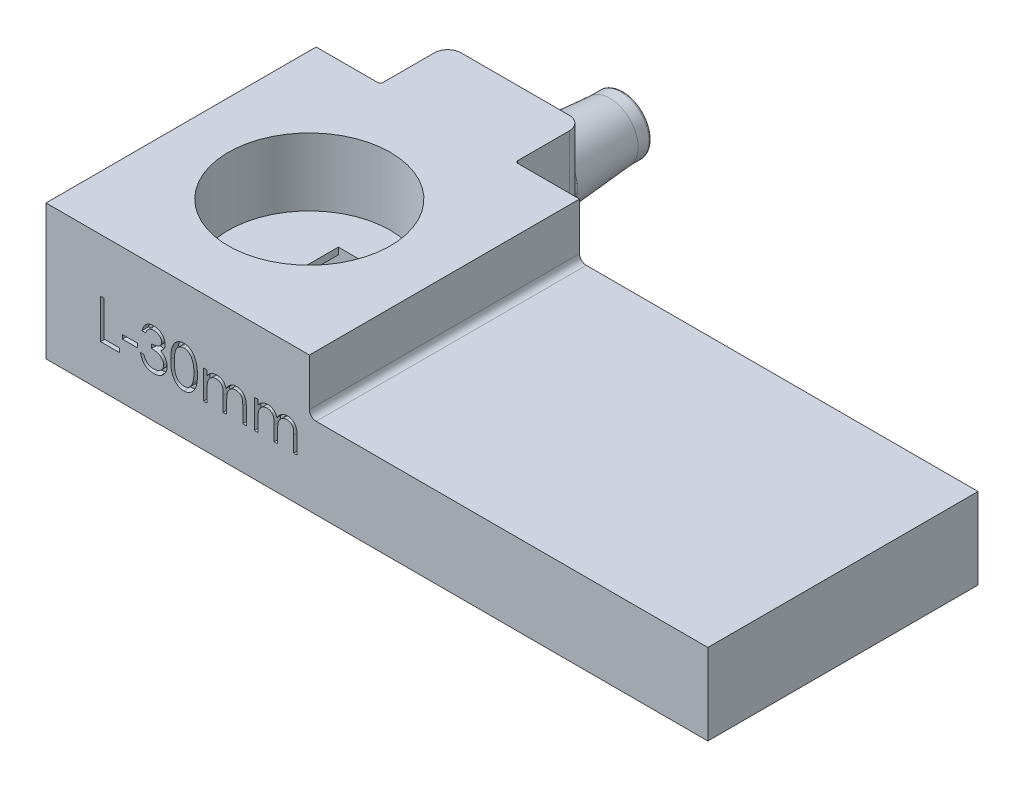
from build123d import *

# Parameters (mm, degrees)
SKETCH2_W           = 49
SKETCH2_H           = 20
BOSS_EXTRUDE1_DEPTH = 10
SKETCH3_W           = 30
SKETCH3_H           = 3.02
CUT_EXTRUDE1_DEPTH  = 2
SKETCH4_W           = 5
SKETCH4_H           = 6
CUT_EXTRUDE2_DEPTH  = 5
SKETCH5_R           = 6
CUT_EXTRUDE3_DEPTH  = 38.474986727
SKETCH6_W           = 1.65
SKETCH6_H           = 6
BOSS_EXTRUDE2_DEPTH = 0.5
SKETCH11_R          = 2
CUT_EXTRUDE4_DEPTH  = 2
SKETCH12_W          = 5
SKETCH12_H          = 6
BOSS_EXTRUDE4_DEPTH = 0.8
SKETCH14_W          = 29.5
SKETCH14_H          = 4
CUT_EXTRUDE6_DEPTH  = 42.177221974
FILLET1_R           = 0.5
SKETCH13_W          = 1.119391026
SKETCH13_H          = 0.298504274
CUT_EXTRUDE5_DEPTH  = 0.5
SKETCH19_W          = 10
SKETCH19_H          = 4.99
BOSS_EXTRUDE5_DEPTH = 10
FILLET2_R           = 1
CUT_EXTRUDE7_REACH  = 45.819
SKETCH20_R          = 0.5
SKETCH21_R          = 1.4
CUT_EXTRUDE8_DEPTH  = 10
FILLET3_R           = 0.2


with BuildPart() as part:
    # Sketch2 → Boss-Extrude1 (new body)
    with BuildSketch(Plane(origin=(0, 0, 0), x_dir=(1, 0, 0), z_dir=(0, 1, 0))):
        with Locations((10.076923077, 3.557692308)):
            Rectangle(SKETCH2_W, SKETCH2_H)
    extrude(amount=BOSS_EXTRUDE1_DEPTH)

    # Sketch3 → Cut-Extrude1 (cut)
    with BuildSketch(Plane.XZ):
        with Locations((12.576923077, -3.557692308)):
            Rectangle(SKETCH3_W, SKETCH3_H)
    extrude(amount=-CUT_EXTRUDE1_DEPTH, mode=Mode.SUBTRACT)

    # Sketch4 → Cut-Extrude2 (cut)
    with BuildSketch(Plane.XZ):
        with Locations((-4.923076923, -3.547692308)):
            Rectangle(SKETCH4_W, SKETCH4_H)
    extrude(amount=-CUT_EXTRUDE2_DEPTH, mode=Mode.SUBTRACT)

    # Sketch5 → Cut-Extrude3 (cut, through all)
    with BuildSketch(Plane.XZ.offset(-5)):
        with Locations(Location((-4.923076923, -3.552692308, 0), (0, 0, 270))):
            Circle(SKETCH5_R)
    extrude(amount=-CUT_EXTRUDE3_DEPTH, mode=Mode.SUBTRACT)

    # Sketch6 → Boss-Extrude2 (add)
    with BuildSketch(Plane(origin=(0, 5, 0), x_dir=(1, 0, 0), z_dir=(0, 1, 0))):
        with Locations((-3.248076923, 3.547692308)):
            Rectangle(SKETCH6_W, SKETCH6_H)
        with Locations((-6.598076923, 3.547692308)):
            Rectangle(SKETCH6_W, SKETCH6_H)
    extrude(amount=-BOSS_EXTRUDE2_DEPTH)

    # Sketch11 → Cut-Extrude4 (cut)
    with BuildSketch(Plane.XZ):
        with Locations((28.888372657, -3.557692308)):
            Circle(SKETCH11_R)
    extrude(amount=-CUT_EXTRUDE4_DEPTH, mode=Mode.SUBTRACT)

    # Sketch12 → Boss-Extrude4 (add)
    with BuildSketch(Plane.XZ):
        with Locations((-4.923076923, -3.547692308)):
            Rectangle(SKETCH12_W, SKETCH12_H)
    extrude(amount=-BOSS_EXTRUDE4_DEPTH)

    # Sketch14 → Cut-Extrude6 (cut, through all)
    with BuildSketch(Plane.XY.offset(6.442307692)):
        with Locations((19.826923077, 8)):
            Rectangle(SKETCH14_W, SKETCH14_H)
    extrude(amount=-CUT_EXTRUDE6_DEPTH, mode=Mode.SUBTRACT)

    # Fillet1
    fillet1_edges = [part.edges().sort_by_distance(p)[0] for p in [
        (5.076923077, 6, -3.557692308),
    ]]
    fillet(fillet1_edges, radius=FILLET1_R)

    # Sketch13 → Cut-Extrude5 (cut)
    # profile 1 of 6: a face of its own
    with BuildSketch(Plane.XY.offset(6.442307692)):
        Polygon((-10.374825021, 6.036177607), (-10.113633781, 6.036177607), (-10.113633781, 3.424265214), (-8.994242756, 3.424265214), (-8.994242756, 3.12576094), (-10.374825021, 3.12576094), align=None)
    # profile 2 of 6: a face of its own
    with BuildSketch(Plane.XY.offset(6.442307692)):
        with Locations((-8.210669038, 4.245151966)):
            Rectangle(SKETCH13_W, SKETCH13_H)
    # profile 3 of 6: a face of its own
    with BuildSketch(Plane.XY.offset(6.442307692)):
        with BuildLine():
            Line((-7.053964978, 5.364542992), (-7.315156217, 5.364542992))
            add(Edge.make_bspline(
                [(-7.315156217, 5.364542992), (-7.308080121, 5.39384048), (-7.294246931, 5.451114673), (-7.265394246, 5.532944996), (-7.233962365, 5.610381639), (-7.196219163, 5.681974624), (-7.155050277, 5.749162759), (-7.107882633, 5.810422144), (-7.056892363, 5.867310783), (-7.000492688, 5.917796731), (-6.941345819, 5.963513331), (-6.878618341, 6.002492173), (-6.81357228, 6.036023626), (-6.745756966, 6.063647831), (-6.674970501, 6.084457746), (-6.601852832, 6.099555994), (-6.52621235, 6.109360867), (-6.474866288, 6.110317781), (-6.448794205, 6.110803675)],
                knots=[0, 0, 0, 0, 1.162005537, 2.271625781, 3.343758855, 4.383309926, 5.390229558, 6.379919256, 7.361854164, 8.333198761, 9.295911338, 10.242430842, 11.177959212, 12.116337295, 13.062827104, 14.020064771, 14.994644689, 16, 16, 16, 16], degree=3))
            add(Edge.make_bspline(
                [(-6.448794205, 6.110803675), (-6.410806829, 6.10965678), (-6.335660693, 6.107388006), (-6.225261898, 6.086670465), (-6.118801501, 6.05388659), (-6.017444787, 6.008589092), (-5.923298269, 5.952719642), (-5.839531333, 5.886225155), (-5.767279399, 5.810388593), (-5.706664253, 5.726624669), (-5.659203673, 5.637103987), (-5.624206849, 5.54496838), (-5.602901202, 5.450436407), (-5.60014, 5.386609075), (-5.598756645, 5.354631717)],
                knots=[0, 0, 0, 0, 1.083050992, 2.142477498, 3.193116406, 4.255571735, 5.30263384, 6.308962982, 7.297363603, 8.282367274, 9.249857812, 10.179914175, 11.08814088, 12, 12, 12, 12], degree=3))
            add(Edge.make_bspline(
                [(-5.598756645, 5.354631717), (-5.599724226, 5.323858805), (-5.601617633, 5.263640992), (-5.617694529, 5.175728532), (-5.644749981, 5.092871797), (-5.682227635, 5.014721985), (-5.730741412, 4.941774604), (-5.789509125, 4.873865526), (-5.858945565, 4.810693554), (-5.911565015, 4.77450504), (-5.938655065, 4.755874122)],
                knots=[0, 0, 0, 0, 1.024540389, 2.004866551, 2.965041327, 3.920577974, 4.882998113, 5.874504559, 6.905732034, 8, 8, 8, 8], degree=3))
            add(Edge.make_bspline(
                [(-5.938655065, 4.755874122), (-5.907695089, 4.740924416), (-5.84635442, 4.711304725), (-5.762741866, 4.653216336), (-5.686839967, 4.586146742), (-5.6445111, 4.533806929), (-5.623243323, 4.507509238)],
                knots=[0, 0, 0, 0, 1.015518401, 2.012035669, 3.001164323, 4, 4, 4, 4], degree=3))
            add(Edge.make_bspline(
                [(-5.623243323, 4.507509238), (-5.609238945, 4.488335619), (-5.58145952, 4.450302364), (-5.54717021, 4.389153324), (-5.51606275, 4.32732652), (-5.491822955, 4.2631648), (-5.47305171, 4.197411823), (-5.459633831, 4.129954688), (-5.45129828, 4.060738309), (-5.45010455, 4.0139118), (-5.449504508, 3.990373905)],
                knots=[0, 0, 0, 0, 1.025084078, 2.033381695, 3.024893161, 4.013698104, 4.991890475, 5.976764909, 6.982997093, 8, 8, 8, 8], degree=3))
            add(Edge.make_bspline(
                [(-5.449504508, 3.990373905), (-5.450996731, 3.949619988), (-5.453974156, 3.868303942), (-5.480587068, 3.748166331), (-5.52184284, 3.630730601), (-5.580431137, 3.51840944), (-5.65183406, 3.413318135), (-5.736782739, 3.3192898), (-5.834311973, 3.238464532), (-5.943083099, 3.17093436), (-6.06092764, 3.116952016), (-6.186969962, 3.079484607), (-6.319393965, 3.055082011), (-6.410205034, 3.05246524), (-6.456373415, 3.051134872)],
                knots=[0, 0, 0, 0, 0.955779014, 1.907060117, 2.875433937, 3.871313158, 4.872415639, 5.851225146, 6.836215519, 7.83643374, 8.849228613, 9.86973379, 10.916971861, 12, 12, 12, 12], degree=3))
            add(Edge.make_bspline(
                [(-6.456373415, 3.051134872), (-6.487489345, 3.051856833), (-6.548715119, 3.053277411), (-6.638724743, 3.062988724), (-6.724641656, 3.080725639), (-6.806582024, 3.104593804), (-6.88461864, 3.13485527), (-6.958513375, 3.172539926), (-7.028720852, 3.216870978), (-7.094578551, 3.268371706), (-7.156078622, 3.325982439), (-7.211586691, 3.390725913), (-7.262028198, 3.461405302), (-7.306052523, 3.538841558), (-7.345664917, 3.622033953), (-7.378245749, 3.712047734), (-7.406922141, 3.808078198), (-7.42025473, 3.874999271), (-7.42709532, 3.909334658)],
                knots=[0, 0, 0, 0, 1.048658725, 2.063410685, 3.046034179, 4.001477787, 4.936774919, 5.862367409, 6.792675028, 7.730719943, 8.675894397, 9.627829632, 10.600096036, 11.597688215, 12.626045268, 13.701542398, 14.82072376, 16, 16, 16, 16], degree=3))
            Line((-7.42709532, 3.909334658), (-7.16590408, 3.909334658))
            add(Edge.make_bspline(
                [(-7.16590408, 3.909334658), (-7.159099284, 3.886925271), (-7.145863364, 3.843337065), (-7.123333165, 3.780604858), (-7.097664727, 3.723096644), (-7.070128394, 3.67039056), (-7.04120846, 3.621967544), (-7.008848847, 3.579108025), (-6.97544629, 3.539929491), (-6.950267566, 3.517856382), (-6.937944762, 3.507053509)],
                knots=[0, 0, 0, 0, 1.198163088, 2.33053128, 3.407730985, 4.417276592, 5.372219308, 6.28897303, 7.162600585, 8, 8, 8, 8], degree=3))
            add(Edge.make_bspline(
                [(-6.937944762, 3.507053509), (-6.921649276, 3.494490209), (-6.889108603, 3.469402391), (-6.836082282, 3.437386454), (-6.780314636, 3.409645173), (-6.720597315, 3.388454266), (-6.658218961, 3.370511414), (-6.592171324, 3.35876953), (-6.523037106, 3.350713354), (-6.475832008, 3.350002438), (-6.451709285, 3.349639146)],
                knots=[0, 0, 0, 0, 0.946170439, 1.889420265, 2.845303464, 3.807233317, 4.801018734, 5.828864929, 6.890507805, 8, 8, 8, 8], degree=3))
            add(Edge.make_bspline(
                [(-6.451709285, 3.349639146), (-6.424473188, 3.3501513), (-6.371215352, 3.351152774), (-6.293503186, 3.360362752), (-6.219572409, 3.373775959), (-6.150243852, 3.39449229), (-6.084609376, 3.420088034), (-6.02358904, 3.452226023), (-5.966381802, 3.489932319), (-5.913720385, 3.532789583), (-5.866367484, 3.579706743), (-5.824674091, 3.628778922), (-5.789229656, 3.679799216), (-5.760638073, 3.733049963), (-5.738061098, 3.78831065), (-5.722691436, 3.845736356), (-5.712004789, 3.904857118), (-5.711134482, 3.945044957), (-5.710695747, 3.96530421)],
                knots=[0, 0, 0, 0, 1.217147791, 2.380027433, 3.494444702, 4.572153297, 5.609568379, 6.639424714, 7.649109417, 8.668170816, 9.669597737, 10.625200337, 11.543417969, 12.441394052, 13.322311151, 14.205496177, 15.095365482, 16, 16, 16, 16], degree=3))
            add(Edge.make_bspline(
                [(-5.710695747, 3.96530421), (-5.711968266, 3.992422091), (-5.714506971, 4.046522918), (-5.733889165, 4.126116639), (-5.765769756, 4.202804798), (-5.810401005, 4.275278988), (-5.864730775, 4.342447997), (-5.928231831, 4.402378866), (-6.001431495, 4.451831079), (-6.068803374, 4.485998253), (-6.128479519, 4.509312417), (-6.179549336, 4.524841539), (-6.236723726, 4.537991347), (-6.299311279, 4.550225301), (-6.367783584, 4.560637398), (-6.442066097, 4.569320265), (-6.522173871, 4.57626788), (-6.577630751, 4.579370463), (-6.606208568, 4.580969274)],
                knots=[0, 0, 0, 0, 1.07054697, 2.135767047, 3.216561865, 4.33974944, 5.486079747, 6.621378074, 7.775625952, 8.963672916, 9.598146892, 10.304877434, 11.070270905, 11.915000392, 12.823868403, 13.805723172, 14.86925407, 16, 16, 16, 16], degree=3))
            Line((-6.606208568, 4.580969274), (-6.606208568, 4.879473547))
            add(Edge.make_bspline(
                [(-6.606208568, 4.879473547), (-6.570201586, 4.880084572), (-6.499672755, 4.881281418), (-6.396648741, 4.895757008), (-6.298132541, 4.915781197), (-6.206307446, 4.94645299), (-6.122613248, 4.982076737), (-6.050002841, 5.023531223), (-5.989493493, 5.069611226), (-5.941379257, 5.121027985), (-5.90518263, 5.176172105), (-5.878717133, 5.233645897), (-5.863083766, 5.293953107), (-5.860996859, 5.335110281), (-5.859947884, 5.355797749)],
                knots=[0, 0, 0, 0, 1.321986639, 2.589447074, 3.816329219, 5.01088745, 6.139805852, 7.153945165, 8.075214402, 8.924034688, 9.728124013, 10.488707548, 11.240355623, 12, 12, 12, 12], degree=3))
            add(Edge.make_bspline(
                [(-5.859947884, 5.355797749), (-5.860292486, 5.370996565), (-5.860978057, 5.401233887), (-5.869623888, 5.445409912), (-5.882616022, 5.488235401), (-5.90047744, 5.529528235), (-5.924384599, 5.569002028), (-5.952994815, 5.606993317), (-5.987061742, 5.643285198), (-6.026099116, 5.677112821), (-6.068018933, 5.709351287), (-6.113961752, 5.736720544), (-6.162542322, 5.760124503), (-6.21381443, 5.779424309), (-6.267944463, 5.793942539), (-6.324678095, 5.804366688), (-6.384123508, 5.810884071), (-6.424679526, 5.811822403), (-6.445296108, 5.812299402)],
                knots=[0, 0, 0, 0, 0.884392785, 1.759457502, 2.611959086, 3.489218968, 4.37281399, 5.2945488, 6.255912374, 7.266815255, 8.301784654, 9.332968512, 10.37626691, 11.440494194, 12.520033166, 13.637162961, 14.798855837, 16, 16, 16, 16], degree=3))
            add(Edge.make_bspline(
                [(-6.445296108, 5.812299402), (-6.478434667, 5.811142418), (-6.543161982, 5.80888256), (-6.636474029, 5.789089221), (-6.723220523, 5.757508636), (-6.789527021, 5.719812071), (-6.838490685, 5.682599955), (-6.873479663, 5.650101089), (-6.907839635, 5.613984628), (-6.939310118, 5.572026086), (-6.971136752, 5.527066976), (-7.000111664, 5.476821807), (-7.02826761, 5.422601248), (-7.045233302, 5.384270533), (-7.053964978, 5.364542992)],
                knots=[0, 0, 0, 0, 1.472543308, 2.876219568, 4.221790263, 5.565193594, 6.249813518, 6.953379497, 7.687249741, 8.463570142, 9.283606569, 10.136032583, 11.040678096, 12, 12, 12, 12], degree=3))
        make_face()
    # profile 4 of 6: a face of its own
    with BuildSketch(Plane.XY.offset(6.442307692)):
        with BuildLine():
            add(Edge.make_bspline(
                [(-5.188313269, 4.579803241), (-5.188040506, 4.626450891), (-5.18751066, 4.717064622), (-5.181616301, 4.849101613), (-5.171824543, 4.972969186), (-5.158405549, 5.088673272), (-5.142075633, 5.196243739), (-5.120276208, 5.295393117), (-5.095485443, 5.386580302), (-5.066753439, 5.470102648), (-5.034333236, 5.547085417), (-4.999047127, 5.618952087), (-4.959494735, 5.68559392), (-4.917936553, 5.748074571), (-4.872690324, 5.805371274), (-4.825043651, 5.858293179), (-4.773136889, 5.905617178), (-4.718734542, 5.948729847), (-4.661344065, 5.986523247), (-4.602601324, 6.019812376), (-4.542101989, 6.048251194), (-4.479680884, 6.070611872), (-4.415899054, 6.089081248), (-4.350533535, 6.101711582), (-4.283476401, 6.109658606), (-4.238214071, 6.110418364), (-4.215259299, 6.110803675)],
                knots=[0, 0, 0, 0, 1.646270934, 3.197905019, 4.663502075, 6.030701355, 7.308322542, 8.50163776, 9.611534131, 10.641858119, 11.616356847, 12.558055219, 13.465016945, 14.349605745, 15.204443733, 16.039544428, 16.859896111, 17.680448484, 18.487036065, 19.28249412, 20.06191084, 20.843045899, 21.620316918, 22.403196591, 23.190181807, 24, 24, 24, 24], degree=3))
            add(Edge.make_bspline(
                [(-4.215259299, 6.110803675), (-4.192112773, 6.110398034), (-4.146081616, 6.109591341), (-4.078027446, 6.101838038), (-4.011545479, 6.088973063), (-3.946919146, 6.070744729), (-3.883617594, 6.048130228), (-3.822135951, 6.019785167), (-3.762092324, 5.9867903), (-3.704440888, 5.948020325), (-3.648548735, 5.904794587), (-3.595788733, 5.85593063), (-3.546156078, 5.801921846), (-3.499027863, 5.743346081), (-3.455741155, 5.679079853), (-3.414518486, 5.610240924), (-3.377621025, 5.535625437), (-3.342085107, 5.456478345), (-3.311411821, 5.370609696), (-3.283749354, 5.278503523), (-3.261398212, 5.179071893), (-3.242780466, 5.072836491), (-3.228357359, 4.959407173), (-3.217852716, 4.839027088), (-3.212303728, 4.711617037), (-3.211258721, 4.624505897), (-3.210722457, 4.579803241)],
                knots=[0, 0, 0, 0, 0.810914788, 1.612654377, 2.396697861, 3.181598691, 3.963628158, 4.749916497, 5.551656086, 6.361998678, 7.18212741, 8.025565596, 8.878627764, 9.750805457, 10.657531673, 11.591944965, 12.560506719, 13.57287815, 14.630710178, 15.753379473, 16.941251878, 18.199788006, 19.531962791, 20.947069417, 22.433333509, 24, 24, 24, 24], degree=3))
            add(Edge.make_bspline(
                [(-3.210722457, 4.579803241), (-3.21126428, 4.535295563), (-3.212320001, 4.448574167), (-3.217790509, 4.321737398), (-3.228566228, 4.201996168), (-3.242045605, 4.089063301), (-3.26071465, 3.983408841), (-3.28366966, 3.884667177), (-3.309156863, 3.792411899), (-3.340618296, 3.707398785), (-3.375053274, 3.628441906), (-3.412518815, 3.554710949), (-3.452657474, 3.485554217), (-3.49638752, 3.421525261), (-3.542998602, 3.362170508), (-3.593488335, 3.308537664), (-3.646433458, 3.259334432), (-3.702490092, 3.215552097), (-3.76104065, 3.177230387), (-3.820878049, 3.142959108), (-3.883063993, 3.11532454), (-3.946189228, 3.091596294), (-4.011156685, 3.07346818), (-4.07788538, 3.060933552), (-4.146035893, 3.052142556), (-4.192104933, 3.05147193), (-4.215259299, 3.051134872)],
                knots=[0, 0, 0, 0, 1.561518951, 3.042555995, 4.452378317, 5.7783523, 7.031515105, 8.214008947, 9.334062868, 10.386615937, 11.391082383, 12.354592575, 13.286541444, 14.194233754, 15.072674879, 15.931287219, 16.775624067, 17.606195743, 18.42308326, 19.229000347, 20.022332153, 20.807536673, 21.593273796, 22.3848459, 23.188221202, 24, 24, 24, 24], degree=3))
            add(Edge.make_bspline(
                [(-4.215259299, 3.051134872), (-4.238213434, 3.051522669), (-4.283474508, 3.052287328), (-4.350540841, 3.060198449), (-4.41563642, 3.072917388), (-4.479082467, 3.090726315), (-4.541204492, 3.112525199), (-4.601155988, 3.140925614), (-4.659603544, 3.173633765), (-4.716391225, 3.210883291), (-4.770451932, 3.253559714), (-4.82208988, 3.300761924), (-4.870007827, 3.35366782), (-4.914607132, 3.411442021), (-4.956994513, 3.473553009), (-4.99598526, 3.540848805), (-5.03205019, 3.613062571), (-5.065015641, 3.690660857), (-5.094243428, 3.774775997), (-5.120061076, 3.866370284), (-5.140445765, 3.966252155), (-5.157894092, 4.073619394), (-5.171967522, 4.188933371), (-5.181575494, 4.312256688), (-5.187513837, 4.443512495), (-5.188041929, 4.533543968), (-5.188313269, 4.579803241)],
                knots=[0, 0, 0, 0, 0.810891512, 1.598919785, 2.382837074, 3.152667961, 3.926044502, 4.706494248, 5.493654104, 6.291793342, 7.103789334, 7.925228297, 8.761435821, 9.622817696, 10.50288917, 11.416980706, 12.369136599, 13.353924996, 14.394355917, 15.514179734, 16.714354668, 17.994756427, 19.357759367, 20.818452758, 22.365282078, 24, 24, 24, 24], degree=3))
        make_face()
        with BuildLine():
            add(Edge.make_bspline(
                [(-4.927122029, 4.580969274), (-4.927022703, 4.542095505), (-4.926829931, 4.466649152), (-4.921793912, 4.357015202), (-4.914933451, 4.254759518), (-4.906084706, 4.159752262), (-4.892943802, 4.072315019), (-4.878219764, 3.99184642), (-4.860301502, 3.918772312), (-4.83910118, 3.852591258), (-4.814953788, 3.792180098), (-4.788588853, 3.735966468), (-4.76026574, 3.683286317), (-4.728567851, 3.634612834), (-4.694046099, 3.589787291), (-4.65748024, 3.548016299), (-4.617505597, 3.510765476), (-4.562204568, 3.466089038), (-4.489197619, 3.419922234), (-4.397211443, 3.379720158), (-4.302690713, 3.354455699), (-4.238535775, 3.351242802), (-4.206514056, 3.349639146)],
                knots=[0, 0, 0, 0, 1.459021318, 2.831673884, 4.118529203, 5.306027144, 6.411944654, 7.436330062, 8.375795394, 9.233974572, 10.042671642, 10.816086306, 11.563610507, 12.285937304, 12.993564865, 13.685989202, 14.367179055, 15.041617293, 16.353048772, 17.594441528, 18.799311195, 20, 20, 20, 20], degree=3))
            add(Edge.make_bspline(
                [(-4.206514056, 3.349639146), (-4.174285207, 3.350967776), (-4.109894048, 3.353622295), (-4.01581791, 3.379232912), (-3.924488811, 3.417874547), (-3.852915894, 3.463566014), (-3.798464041, 3.507079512), (-3.759450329, 3.544178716), (-3.723642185, 3.585719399), (-3.689680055, 3.63053923), (-3.65853105, 3.679494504), (-3.630205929, 3.732349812), (-3.604358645, 3.789251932), (-3.58963273, 3.828974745), (-3.58210375, 3.849283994)],
                knots=[0, 0, 0, 0, 1.353760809, 2.704726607, 4.075137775, 5.516104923, 6.260822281, 7.007110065, 7.778089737, 8.566572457, 9.372053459, 10.217411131, 11.088608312, 12, 12, 12, 12], degree=3))
            add(Edge.make_bspline(
                [(-3.58210375, 3.849283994), (-3.573329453, 3.875253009), (-3.555513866, 3.927981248), (-3.532553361, 4.009775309), (-3.514471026, 4.095593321), (-3.498203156, 4.184922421), (-3.487099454, 4.278421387), (-3.478162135, 4.375800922), (-3.472897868, 4.477134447), (-3.47224531, 4.545982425), (-3.471913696, 4.580969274)],
                knots=[0, 0, 0, 0, 0.884706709, 1.796334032, 2.740027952, 3.714592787, 4.726048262, 5.777819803, 6.87074269, 8, 8, 8, 8], degree=3))
            add(Edge.make_bspline(
                [(-3.471913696, 4.580969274), (-3.472371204, 4.615950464), (-3.473266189, 4.684381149), (-3.476687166, 4.784597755), (-3.485521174, 4.879783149), (-3.495332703, 4.970347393), (-3.509799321, 5.055789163), (-3.52539733, 5.136823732), (-3.546353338, 5.212447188), (-3.568738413, 5.283843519), (-3.594358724, 5.350201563), (-3.622561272, 5.411830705), (-3.65268139, 5.46902848), (-3.685396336, 5.521637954), (-3.720317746, 5.569894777), (-3.758367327, 5.612831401), (-3.798035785, 5.651778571), (-3.853597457, 5.696235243), (-3.926336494, 5.741564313), (-4.016846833, 5.783279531), (-4.111036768, 5.807234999), (-4.174711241, 5.810612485), (-4.206514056, 5.812299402)],
                knots=[0, 0, 0, 0, 1.31362396, 2.569729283, 3.763502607, 4.902122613, 5.988968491, 7.01645872, 7.998833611, 8.933434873, 9.825090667, 10.667526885, 11.477055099, 12.250526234, 12.991942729, 13.710640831, 14.402115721, 15.076753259, 16.378508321, 17.609869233, 18.806226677, 20, 20, 20, 20], degree=3))
            add(Edge.make_bspline(
                [(-4.206514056, 5.812299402), (-4.238703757, 5.810610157), (-4.3031418, 5.807228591), (-4.398310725, 5.783368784), (-4.489535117, 5.741780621), (-4.562081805, 5.696085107), (-4.617682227, 5.652563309), (-4.656833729, 5.614822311), (-4.693543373, 5.573539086), (-4.727360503, 5.528301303), (-4.759033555, 5.479684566), (-4.788121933, 5.427306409), (-4.814330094, 5.3709014), (-4.83851527, 5.310517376), (-4.859780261, 5.244342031), (-4.877320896, 5.171357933), (-4.893525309, 5.091145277), (-4.904996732, 5.003234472), (-4.915194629, 4.908203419), (-4.921748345, 4.805692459), (-4.926846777, 4.695874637), (-4.927028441, 4.620038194), (-4.927122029, 4.580969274)],
                knots=[0, 0, 0, 0, 1.207732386, 2.417664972, 3.655092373, 4.956220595, 5.625982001, 6.301752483, 6.994047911, 7.697131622, 8.419323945, 9.170223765, 9.943494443, 10.752040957, 11.610060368, 12.549350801, 13.567764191, 14.679664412, 15.874934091, 17.154273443, 18.533957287, 20, 20, 20, 20], degree=3))
        make_face(mode=Mode.SUBTRACT)
    # profile 5 of 6: a face of its own
    with BuildSketch(Plane.XY.offset(6.442307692)):
        with BuildLine():
            Line((-2.762966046, 5.252603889), (-2.501774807, 5.252603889))
            Line((-2.501774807, 5.252603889), (-2.501774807, 4.882971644))
            add(Edge.make_bspline(
                [(-2.501774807, 4.882971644), (-2.478255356, 4.915308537), (-2.433189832, 4.977269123), (-2.359293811, 5.05891902), (-2.285472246, 5.128210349), (-2.232308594, 5.16458463), (-2.20676863, 5.182058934)],
                knots=[0, 0, 0, 0, 1.134379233, 2.173579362, 3.122582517, 4, 4, 4, 4], degree=3))
            add(Edge.make_bspline(
                [(-2.20676863, 5.182058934), (-2.17195617, 5.198694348), (-2.102939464, 5.231674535), (-1.993658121, 5.265130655), (-1.88183603, 5.285690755), (-1.806324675, 5.288502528), (-1.768340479, 5.289916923)],
                knots=[0, 0, 0, 0, 1.014936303, 2.012140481, 3.000054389, 4, 4, 4, 4], degree=3))
            add(Edge.make_bspline(
                [(-1.768340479, 5.289916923), (-1.742651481, 5.289047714), (-1.691814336, 5.287327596), (-1.616489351, 5.276134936), (-1.543430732, 5.256788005), (-1.473070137, 5.229839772), (-1.406778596, 5.197204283), (-1.346001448, 5.158911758), (-1.291431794, 5.115923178), (-1.243097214, 5.066297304), (-1.199633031, 5.00864062), (-1.15965318, 4.941398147), (-1.122711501, 4.86305999), (-1.10223771, 4.806209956), (-1.091458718, 4.776279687)],
                knots=[0, 0, 0, 0, 1.009824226, 1.998387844, 2.986035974, 3.974953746, 4.955485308, 5.885931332, 6.793869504, 7.679848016, 8.601185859, 9.625726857, 10.749998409, 12, 12, 12, 12], degree=3))
            add(Edge.make_bspline(
                [(-1.091458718, 4.776279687), (-1.080057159, 4.796839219), (-1.057620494, 4.837297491), (-1.019946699, 4.894556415), (-0.980474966, 4.948113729), (-0.938868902, 4.998011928), (-0.895275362, 5.044004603), (-0.849489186, 5.086243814), (-0.801771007, 5.124910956), (-0.73541996, 5.17008325), (-0.649094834, 5.21806453), (-0.540255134, 5.259665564), (-0.427039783, 5.285373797), (-0.350190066, 5.288392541), (-0.311383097, 5.289916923)],
                knots=[0, 0, 0, 0, 0.86119277, 1.694706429, 2.50939023, 3.298075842, 4.073795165, 4.829715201, 5.57930267, 6.321991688, 7.768977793, 9.186738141, 10.579381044, 12, 12, 12, 12], degree=3))
            add(Edge.make_bspline(
                [(-0.311383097, 5.289916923), (-0.275725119, 5.288572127), (-0.205938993, 5.285940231), (-0.104342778, 5.265273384), (-0.009594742, 5.229784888), (0.07811447, 5.181360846), (0.157244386, 5.120508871), (0.226026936, 5.048106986), (0.284044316, 4.964667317), (0.321945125, 4.886175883), (0.347652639, 4.816878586), (0.363502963, 4.757833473), (0.377505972, 4.692846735), (0.389132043, 4.621840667), (0.397629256, 4.544564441), (0.403924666, 4.461144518), (0.408185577, 4.371516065), (0.408486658, 4.309677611), (0.40864186, 4.277800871)],
                knots=[0, 0, 0, 0, 1.209669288, 2.367440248, 3.500751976, 4.631527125, 5.755587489, 6.87532382, 8.007944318, 9.190864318, 9.82315674, 10.514484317, 11.263564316, 12.079023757, 12.955305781, 13.901327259, 14.918167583, 16, 16, 16, 16], degree=3))
            Line((0.40864186, 4.277800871), (0.40864186, 3.12576094))
            Line((0.40864186, 3.12576094), (0.14745062, 3.12576094))
            Line((0.14745062, 3.12576094), (0.14745062, 4.278966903))
            add(Edge.make_bspline(
                [(0.14745062, 4.278966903), (0.147385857, 4.306175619), (0.147261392, 4.358466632), (0.145021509, 4.433515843), (0.140801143, 4.501925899), (0.135866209, 4.563603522), (0.129011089, 4.618692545), (0.120158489, 4.667082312), (0.110780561, 4.709153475), (0.095200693, 4.755791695), (0.070297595, 4.807239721), (0.032364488, 4.862723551), (-0.015424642, 4.911020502), (-0.070606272, 4.952945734), (-0.133428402, 4.987033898), (-0.202666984, 5.011378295), (-0.277892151, 5.026448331), (-0.329965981, 5.027950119), (-0.356858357, 5.028725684)],
                knots=[0, 0, 0, 0, 1.253487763, 2.409012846, 3.458416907, 4.410876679, 5.259312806, 6.014470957, 6.676830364, 7.243083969, 8.276244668, 9.299465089, 10.325150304, 11.392391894, 12.482080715, 13.603491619, 14.762376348, 16, 16, 16, 16], degree=3))
            add(Edge.make_bspline(
                [(-0.356858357, 5.028725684), (-0.389845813, 5.027548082), (-0.455041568, 5.025220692), (-0.550208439, 5.001460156), (-0.641654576, 4.965636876), (-0.726651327, 4.913721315), (-0.804839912, 4.851514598), (-0.872111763, 4.777548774), (-0.927685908, 4.693870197), (-0.965316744, 4.616414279), (-0.989090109, 4.546839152), (-1.004787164, 4.486055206), (-1.016997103, 4.416968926), (-1.028447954, 4.340044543), (-1.035921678, 4.254752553), (-1.042714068, 4.161487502), (-1.045891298, 4.059968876), (-1.046335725, 3.989597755), (-1.046566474, 3.95306087)],
                knots=[0, 0, 0, 0, 1.090531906, 2.155305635, 3.229839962, 4.33261226, 5.44038871, 6.529323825, 7.629011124, 8.757537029, 9.370236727, 10.061839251, 10.834451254, 11.692844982, 12.636905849, 13.66920014, 14.789842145, 16, 16, 16, 16], degree=3))
            Line((-1.046566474, 3.95306087), (-1.046566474, 3.12576094))
            Line((-1.046566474, 3.12576094), (-1.307757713, 3.12576094))
            Line((-1.307757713, 3.12576094), (-1.307757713, 4.207255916))
            add(Edge.make_bspline(
                [(-1.307757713, 4.207255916), (-1.307823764, 4.237768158), (-1.307950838, 4.296470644), (-1.310176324, 4.380651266), (-1.314406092, 4.457221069), (-1.319296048, 4.52609106), (-1.326331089, 4.587136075), (-1.334322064, 4.640683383), (-1.343758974, 4.686598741), (-1.359383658, 4.736960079), (-1.383261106, 4.792441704), (-1.421668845, 4.851598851), (-1.469572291, 4.903377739), (-1.525760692, 4.94758177), (-1.588963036, 4.984121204), (-1.658799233, 5.010447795), (-1.734640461, 5.025768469), (-1.786926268, 5.027721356), (-1.813815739, 5.028725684)],
                knots=[0, 0, 0, 0, 1.320475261, 2.540461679, 3.643808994, 4.639130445, 5.527981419, 6.302341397, 6.981980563, 7.553956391, 8.582137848, 9.585246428, 10.591171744, 11.620968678, 12.668337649, 13.738356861, 14.836885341, 16, 16, 16, 16], degree=3))
            add(Edge.make_bspline(
                [(-1.813815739, 5.028725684), (-1.845428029, 5.027453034), (-1.908430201, 5.024916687), (-2.000983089, 5.002087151), (-2.090362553, 4.966327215), (-2.17514274, 4.916717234), (-2.253037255, 4.855266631), (-2.321231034, 4.782992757), (-2.378560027, 4.700795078), (-2.416588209, 4.624155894), (-2.441117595, 4.556323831), (-2.457412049, 4.498655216), (-2.471415, 4.434625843), (-2.481821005, 4.364038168), (-2.491866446, 4.287351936), (-2.496714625, 4.204185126), (-2.501430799, 4.11460908), (-2.501657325, 4.052764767), (-2.501774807, 4.020690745)],
                knots=[0, 0, 0, 0, 1.098833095, 2.189935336, 3.297829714, 4.440610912, 5.596351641, 6.740013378, 7.886572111, 9.072425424, 9.705826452, 10.395263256, 11.156850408, 11.985370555, 12.878090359, 13.847760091, 14.883794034, 16, 16, 16, 16], degree=3))
            Line((-2.501774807, 4.020690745), (-2.501774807, 3.12576094))
            Line((-2.501774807, 3.12576094), (-2.762966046, 3.12576094))
            Line((-2.762966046, 3.12576094), (-2.762966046, 5.252603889))
        make_face()
    # profile 6 of 6: a face of its own
    with BuildSketch(Plane.XY.offset(6.442307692)):
        with BuildLine():
            Line((1.005650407, 5.252603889), (1.266841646, 5.252603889))
            Line((1.266841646, 5.252603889), (1.266841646, 4.882971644))
            add(Edge.make_bspline(
                [(1.266841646, 4.882971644), (1.290361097, 4.915308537), (1.335426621, 4.977269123), (1.409322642, 5.05891902), (1.483144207, 5.128210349), (1.536307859, 5.16458463), (1.561847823, 5.182058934)],
                knots=[0, 0, 0, 0, 1.134379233, 2.173579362, 3.122582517, 4, 4, 4, 4], degree=3))
            add(Edge.make_bspline(
                [(1.561847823, 5.182058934), (1.596660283, 5.198694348), (1.665676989, 5.231674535), (1.774958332, 5.265130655), (1.886780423, 5.285690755), (1.962291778, 5.288502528), (2.000275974, 5.289916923)],
                knots=[0, 0, 0, 0, 1.014936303, 2.012140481, 3.000054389, 4, 4, 4, 4], degree=3))
            add(Edge.make_bspline(
                [(2.000275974, 5.289916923), (2.025964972, 5.289047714), (2.076802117, 5.287327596), (2.152127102, 5.276134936), (2.225185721, 5.256788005), (2.295546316, 5.229839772), (2.361837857, 5.197204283), (2.422615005, 5.158911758), (2.477184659, 5.115923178), (2.525519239, 5.066297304), (2.568983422, 5.00864062), (2.608963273, 4.941398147), (2.645904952, 4.86305999), (2.666378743, 4.806209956), (2.677157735, 4.776279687)],
                knots=[0, 0, 0, 0, 1.009824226, 1.998387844, 2.986035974, 3.974953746, 4.955485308, 5.885931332, 6.793869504, 7.679848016, 8.601185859, 9.625726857, 10.749998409, 12, 12, 12, 12], degree=3))
            add(Edge.make_bspline(
                [(2.677157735, 4.776279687), (2.688559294, 4.796839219), (2.710995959, 4.837297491), (2.748669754, 4.894556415), (2.788141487, 4.948113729), (2.829747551, 4.998011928), (2.873341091, 5.044004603), (2.919127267, 5.086243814), (2.966845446, 5.124910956), (3.033196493, 5.17008325), (3.119521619, 5.21806453), (3.228361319, 5.259665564), (3.34157667, 5.285373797), (3.418426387, 5.288392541), (3.457233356, 5.289916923)],
                knots=[0, 0, 0, 0, 0.86119277, 1.694706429, 2.50939023, 3.298075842, 4.073795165, 4.829715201, 5.57930267, 6.321991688, 7.768977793, 9.186738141, 10.579381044, 12, 12, 12, 12], degree=3))
            add(Edge.make_bspline(
                [(3.457233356, 5.289916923), (3.492891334, 5.288572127), (3.56267746, 5.285940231), (3.664273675, 5.265273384), (3.759021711, 5.229784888), (3.846730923, 5.181360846), (3.925860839, 5.120508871), (3.994643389, 5.048106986), (4.052660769, 4.964667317), (4.090561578, 4.886175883), (4.116269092, 4.816878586), (4.132119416, 4.757833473), (4.146122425, 4.692846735), (4.157748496, 4.621840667), (4.166245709, 4.544564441), (4.172541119, 4.461144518), (4.17680203, 4.371516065), (4.177103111, 4.309677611), (4.177258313, 4.277800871)],
                knots=[0, 0, 0, 0, 1.209669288, 2.367440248, 3.500751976, 4.631527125, 5.755587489, 6.87532382, 8.007944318, 9.190864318, 9.82315674, 10.514484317, 11.263564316, 12.079023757, 12.955305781, 13.901327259, 14.918167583, 16, 16, 16, 16], degree=3))
            Line((4.177258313, 4.277800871), (4.177258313, 3.12576094))
            Line((4.177258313, 3.12576094), (3.916067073, 3.12576094))
            Line((3.916067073, 3.12576094), (3.916067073, 4.278966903))
            add(Edge.make_bspline(
                [(3.916067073, 4.278966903), (3.91600231, 4.306175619), (3.915877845, 4.358466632), (3.913637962, 4.433515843), (3.909417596, 4.501925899), (3.904482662, 4.563603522), (3.897627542, 4.618692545), (3.888774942, 4.667082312), (3.879397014, 4.709153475), (3.863817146, 4.755791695), (3.838914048, 4.807239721), (3.800980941, 4.862723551), (3.753191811, 4.911020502), (3.698010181, 4.952945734), (3.635188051, 4.987033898), (3.565949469, 5.011378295), (3.490724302, 5.026448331), (3.438650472, 5.027950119), (3.411758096, 5.028725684)],
                knots=[0, 0, 0, 0, 1.253487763, 2.409012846, 3.458416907, 4.410876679, 5.259312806, 6.014470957, 6.676830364, 7.243083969, 8.276244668, 9.299465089, 10.325150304, 11.392391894, 12.482080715, 13.603491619, 14.762376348, 16, 16, 16, 16], degree=3))
            add(Edge.make_bspline(
                [(3.411758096, 5.028725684), (3.37877064, 5.027548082), (3.313574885, 5.025220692), (3.218408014, 5.001460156), (3.126961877, 4.965636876), (3.041965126, 4.913721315), (2.963776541, 4.851514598), (2.89650469, 4.777548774), (2.840930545, 4.693870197), (2.803299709, 4.616414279), (2.779526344, 4.546839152), (2.763829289, 4.486055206), (2.75161935, 4.416968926), (2.740168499, 4.340044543), (2.732694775, 4.254752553), (2.725902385, 4.161487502), (2.722725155, 4.059968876), (2.722280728, 3.989597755), (2.722049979, 3.95306087)],
                knots=[0, 0, 0, 0, 1.090531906, 2.155305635, 3.229839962, 4.33261226, 5.44038871, 6.529323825, 7.629011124, 8.757537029, 9.370236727, 10.061839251, 10.834451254, 11.692844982, 12.636905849, 13.66920014, 14.789842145, 16, 16, 16, 16], degree=3))
            Line((2.722049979, 3.95306087), (2.722049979, 3.12576094))
            Line((2.722049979, 3.12576094), (2.46085874, 3.12576094))
            Line((2.46085874, 3.12576094), (2.46085874, 4.207255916))
            add(Edge.make_bspline(
                [(2.46085874, 4.207255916), (2.460792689, 4.237768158), (2.460665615, 4.296470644), (2.458440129, 4.380651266), (2.454210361, 4.457221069), (2.449320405, 4.52609106), (2.442285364, 4.587136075), (2.434294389, 4.640683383), (2.424857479, 4.686598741), (2.409232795, 4.736960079), (2.385355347, 4.792441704), (2.346947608, 4.851598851), (2.299044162, 4.903377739), (2.242855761, 4.94758177), (2.179653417, 4.984121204), (2.10981722, 5.010447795), (2.033975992, 5.025768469), (1.981690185, 5.027721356), (1.954800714, 5.028725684)],
                knots=[0, 0, 0, 0, 1.320475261, 2.540461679, 3.643808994, 4.639130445, 5.527981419, 6.302341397, 6.981980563, 7.553956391, 8.582137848, 9.585246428, 10.591171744, 11.620968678, 12.668337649, 13.738356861, 14.836885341, 16, 16, 16, 16], degree=3))
            add(Edge.make_bspline(
                [(1.954800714, 5.028725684), (1.923188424, 5.027453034), (1.860186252, 5.024916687), (1.767633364, 5.002087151), (1.6782539, 4.966327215), (1.593473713, 4.916717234), (1.515579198, 4.855266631), (1.447385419, 4.782992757), (1.390056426, 4.700795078), (1.352028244, 4.624155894), (1.327498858, 4.556323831), (1.311204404, 4.498655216), (1.297201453, 4.434625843), (1.286795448, 4.364038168), (1.276750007, 4.287351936), (1.271901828, 4.204185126), (1.267185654, 4.11460908), (1.266959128, 4.052764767), (1.266841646, 4.020690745)],
                knots=[0, 0, 0, 0, 1.098833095, 2.189935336, 3.297829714, 4.440610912, 5.596351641, 6.740013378, 7.886572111, 9.072425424, 9.705826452, 10.395263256, 11.156850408, 11.985370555, 12.878090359, 13.847760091, 14.883794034, 16, 16, 16, 16], degree=3))
            Line((1.266841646, 4.020690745), (1.266841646, 3.12576094))
            Line((1.266841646, 3.12576094), (1.005650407, 3.12576094))
            Line((1.005650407, 3.12576094), (1.005650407, 5.252603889))
        make_face()
    extrude(amount=-CUT_EXTRUDE5_DEPTH, mode=Mode.SUBTRACT)

    # Sketch19 → Boss-Extrude5 (add)
    with BuildSketch(Plane(origin=(0, 10, 0), x_dir=(1, 0, 0), z_dir=(0, 1, 0))):
        with Locations((-4.673076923, 16.052692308)):
            Rectangle(SKETCH19_W, SKETCH19_H)
    extrude(amount=-BOSS_EXTRUDE5_DEPTH)

    # Fillet2
    fillet2_edges = [part.edges().sort_by_distance(p)[0] for p in [
        (-9.673076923, 5, -18.547692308),
        (0.326923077, 5, -18.547692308),
    ]]
    fillet(fillet2_edges, radius=FILLET2_R)

    # Sketch20 → Cut-Extrude7 (cut, up to next)
    with BuildSketch(Plane(origin=(0, 0, -18.547692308), x_dir=(-1, 0, 0), z_dir=(0, 0, -1)), mode=Mode.PRIVATE) as cut_extrude7_sk1:
        with Locations((4.673076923, 3.5)):
            Circle(SKETCH20_R)
    cut_extrude7_tool1 = extrude(cut_extrude7_sk1.sketch, amount=-CUT_EXTRUDE7_REACH, mode=Mode.PRIVATE) & part.part
    add(cut_extrude7_tool1.solids().sort_by_distance((-4.673077, 3.5, -18.547692))[0], mode=Mode.SUBTRACT)

    # Sketch21 → Cut-Extrude8 (cut)
    with BuildSketch(Plane(origin=(0, 0, -18.547692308), x_dir=(-1, 0, 0), z_dir=(0, 0, -1))):
        with Locations((4.673076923, 3.5)):
            Circle(SKETCH21_R)
    extrude(amount=-CUT_EXTRUDE8_DEPTH, mode=Mode.SUBTRACT)

    # Sketch23 → Revolve1 (revolve)
    with BuildSketch(Plane(origin=(0, 3.5, 0), x_dir=(-1, 0, 0), z_dir=(0, -1, 0)), mode=Mode.PRIVATE) as revolve1_sk:
        with BuildLine():
            Line((6.273076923, 26.547692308), (6.773076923, 26.547692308))
            Line((6.773076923, 26.547692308), (6.773076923, 25.547692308))
            Line((6.773076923, 25.547692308), (7.173076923, 20.655841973))
            ThreePointArc((7.173076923, 20.655841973), (7.146945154, 20.579924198), (7.073409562, 20.547692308))
            Line((7.073409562, 20.547692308), (6.773076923, 20.547692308))
            Line((6.773076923, 20.547692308), (6.773076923, 18.547692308))
            Line((6.773076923, 18.547692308), (6.273076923, 18.547692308))
            Line((6.273076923, 18.547692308), (6.273076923, 26.547692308))
        make_face()
    revolve(revolve1_sk.sketch.rotate(Axis((-4.673076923, 3.5, -15.613069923), (0, 0, -1)), 180), axis=Axis((-4.673076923, 3.5, -15.613069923), (0, 0, -1)))

    # Fillet3
    fillet3_edges = [part.edges().sort_by_distance(p)[0] for p in [
        (-6.273076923, 3.5, -26.547692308),
        (-6.773076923, 3.5, -26.547692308),
        (-9.673076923, 5, -13.557692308),
        (0.326923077, 5, -13.557692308),
        (-6.773076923, 3.5, -18.547692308),
    ]]
    fillet(fillet3_edges, radius=FILLET3_R)


solid = part.part
